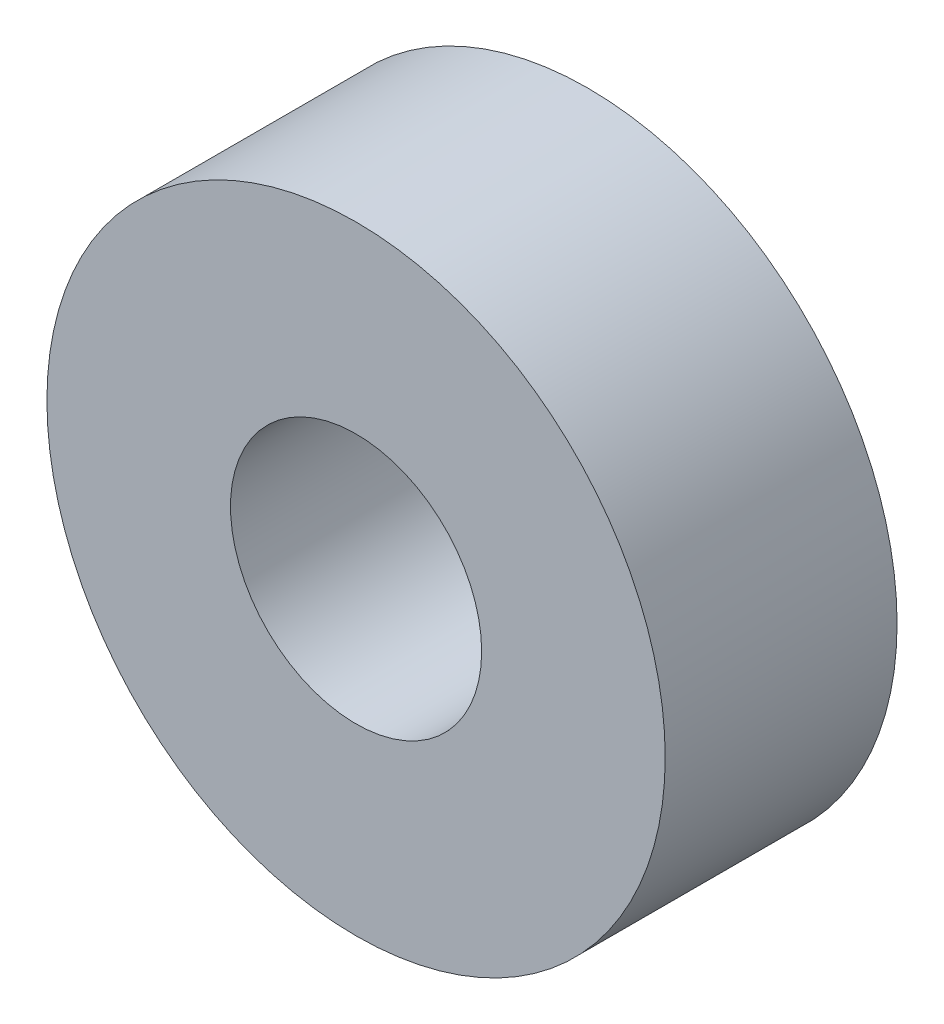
from build123d import *

# Parameters (mm, degrees)
ESQUISSE1_R      = 4
ESQUISSE1_R_2    = 1.625
EXTRUSION1_DEPTH = 3


with BuildPart() as part:
    # Esquisse1 → Extrusion1 (new body)
    with BuildSketch(Plane.XY):
        Circle(ESQUISSE1_R)
        Circle(ESQUISSE1_R_2, mode=Mode.SUBTRACT)
    extrude(amount=EXTRUSION1_DEPTH)


solid = part.part
